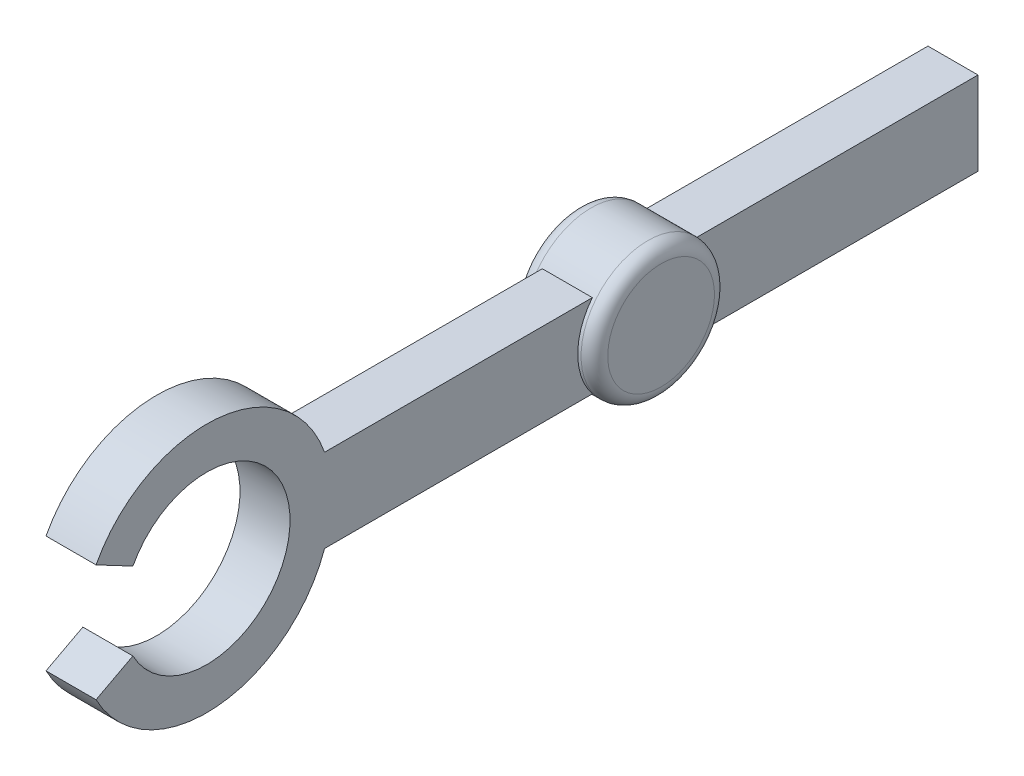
from build123d import *

# Parameters (mm, degrees)
SKETCH1_R                = 10.16
BOSS_EXTRUDE1_DEPTH      = 6.35
BOSS_EXTRUDE2_DEPTH      = 50.8
BOSS_EXTRUDE2_DEPTH_BACK = 50.8
SKETCH2_W                = 7.62
SKETCH2_H                = 12.7
FILLET1_R                = 2.032
BOSS_EXTRUDE3_DEPTH      = 3.81


with BuildPart() as part:
    # Sketch1 → Boss-Extrude1 (new, symmetric)
    with BuildSketch(Plane(origin=(0, 0, 0), x_dir=(0, 0, -1), z_dir=(1, 0, 0))):
        Circle(SKETCH1_R)
    extrude(amount=BOSS_EXTRUDE1_DEPTH, both=True)

    # Sketch2 → Boss-Extrude2 (add, two sides: drawn at the far end of the back side and taken through both)
    with BuildSketch(Plane.XY.offset(-BOSS_EXTRUDE2_DEPTH_BACK)):
        Rectangle(SKETCH2_W, SKETCH2_H)
    extrude(amount=BOSS_EXTRUDE2_DEPTH + BOSS_EXTRUDE2_DEPTH_BACK)

    # Fillet1
    fillet1_edges = [part.edges().sort_by_distance(p)[0] for p in [
        (-6.35, 0, 10.16),
        (6.35, 0, 10.16),
    ]]
    fillet(fillet1_edges, radius=FILLET1_R)

    # Sketch3 → Boss-Extrude3 (add, symmetric)
    with BuildSketch(Plane(origin=(0, 0, 0), x_dir=(0, 0, -1), z_dir=(1, 0, 0))):
        with BuildLine():
            Line((-83.523453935, 8.89), (-77.907302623, 5.926666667))
            ThreePointArc((-77.907302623, 5.926666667), (-53.975, 0), (-77.907302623, -5.926666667))
            Line((-77.907302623, -5.926666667), (-83.523453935, -8.89))
            ThreePointArc((-83.523453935, -8.89), (-47.625, 0), (-83.523453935, 8.89))
        make_face()
    extrude(amount=BOSS_EXTRUDE3_DEPTH, both=True)


solid = part.part
